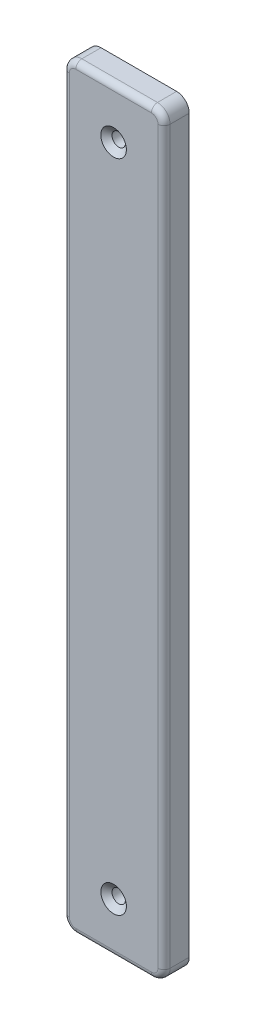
ISO-10303-21;
HEADER;
FILE_DESCRIPTION(('STEP AP214'),'2;1');
FILE_NAME('part.step','',(''),(''),'','','');
FILE_SCHEMA(('AUTOMOTIVE_DESIGN { 1 0 10303 214 1 1 1 1 }'));
ENDSEC;
DATA;
#1=APPLICATION_CONTEXT('core data for automotive mechanical design processes');
#2=APPLICATION_PROTOCOL_DEFINITION('international standard','automotive_design',2000,#1);
#3=PRODUCT_CONTEXT('',#1,'mechanical');
#4=PRODUCT('Part','Part','',(#3));
#5=PRODUCT_RELATED_PRODUCT_CATEGORY('part','',(#4));
#6=PRODUCT_DEFINITION_FORMATION('','',#4);
#7=PRODUCT_DEFINITION_CONTEXT('part definition',#1,'design');
#8=PRODUCT_DEFINITION('design','',#6,#7);
#9=PRODUCT_DEFINITION_SHAPE('','',#8);
#10=(LENGTH_UNIT() NAMED_UNIT(*) SI_UNIT(.MILLI.,.METRE.));
#11=(NAMED_UNIT(*) PLANE_ANGLE_UNIT() SI_UNIT($,.RADIAN.));
#12=(NAMED_UNIT(*) SI_UNIT($,.STERADIAN.) SOLID_ANGLE_UNIT());
#13=UNCERTAINTY_MEASURE_WITH_UNIT(LENGTH_MEASURE(1.E-05),#10,'distance_accuracy_value','');
#14=(GEOMETRIC_REPRESENTATION_CONTEXT(3) GLOBAL_UNCERTAINTY_ASSIGNED_CONTEXT((#13)) GLOBAL_UNIT_ASSIGNED_CONTEXT((#10,
#11,#12)) REPRESENTATION_CONTEXT('',''));
#15=CARTESIAN_POINT('',(0.,0.,0.));
#16=DIRECTION('',(0.,0.,1.));
#17=DIRECTION('',(1.,0.,0.));
#18=AXIS2_PLACEMENT_3D('',#15,#16,#17);
#19=CARTESIAN_POINT('',(25.4,-190.5,12.7));
#20=DIRECTION('',(-1.,0.,0.));
#21=DIRECTION('',(0.,0.,1.));
#22=AXIS2_PLACEMENT_3D('',#19,#20,#21);
#23=PLANE('',#22);
#24=DIRECTION('',(0.,0.,-1.));
#25=VECTOR('',#24,1.);
#26=CARTESIAN_POINT('',(25.4,184.15,12.7));
#27=LINE('',#26,#25);
#28=CARTESIAN_POINT('',(25.4,184.15,0.));
#29=VERTEX_POINT('',#28);
#30=CARTESIAN_POINT('',(25.4,184.15,9.652));
#31=VERTEX_POINT('',#30);
#32=EDGE_CURVE('E138',#29,#31,#27,.F.);
#33=ORIENTED_EDGE('',*,*,#32,.T.);
#34=DIRECTION('',(0.,1.,0.));
#35=VECTOR('',#34,1.);
#36=CARTESIAN_POINT('',(25.4,-190.5,9.652));
#37=LINE('',#36,#35);
#38=CARTESIAN_POINT('',(25.4,-184.15,9.652));
#39=VERTEX_POINT('',#38);
#40=EDGE_CURVE('E134',#31,#39,#37,.F.);
#41=ORIENTED_EDGE('',*,*,#40,.T.);
#42=DIRECTION('',(0.,0.,-1.));
#43=VECTOR('',#42,1.);
#44=CARTESIAN_POINT('',(25.4,-184.15,0.));
#45=LINE('',#44,#43);
#46=CARTESIAN_POINT('',(25.4,-184.15,0.));
#47=VERTEX_POINT('',#46);
#48=EDGE_CURVE('E127',#39,#47,#45,.T.);
#49=ORIENTED_EDGE('',*,*,#48,.T.);
#50=DIRECTION('',(0.,1.,0.));
#51=VECTOR('',#50,1.);
#52=CARTESIAN_POINT('',(25.4,-190.5,0.));
#53=LINE('',#52,#51);
#54=EDGE_CURVE('E131',#47,#29,#53,.T.);
#55=ORIENTED_EDGE('',*,*,#54,.T.);
#56=EDGE_LOOP('',(#33,#41,#49,#55));
#57=FACE_BOUND('',#56,.T.);
#58=ADVANCED_FACE('F36',(#57),#23,.F.);
#59=CARTESIAN_POINT('',(-25.4,190.5,12.7));
#60=DIRECTION('',(0.,1.,0.));
#61=DIRECTION('',(0.,0.,1.));
#62=AXIS2_PLACEMENT_3D('',#59,#60,#61);
#63=PLANE('',#62);
#64=DIRECTION('',(0.,0.,-1.));
#65=VECTOR('',#64,1.);
#66=CARTESIAN_POINT('',(-19.05,190.5,12.7));
#67=LINE('',#66,#65);
#68=CARTESIAN_POINT('',(-19.05,190.5,0.));
#69=VERTEX_POINT('',#68);
#70=CARTESIAN_POINT('',(-19.05,190.5,9.652));
#71=VERTEX_POINT('',#70);
#72=EDGE_CURVE('E186',#69,#71,#67,.F.);
#73=ORIENTED_EDGE('',*,*,#72,.T.);
#74=DIRECTION('',(1.,0.,0.));
#75=VECTOR('',#74,1.);
#76=CARTESIAN_POINT('',(19.05,190.5,9.652));
#77=LINE('',#76,#75);
#78=CARTESIAN_POINT('',(19.05,190.5,9.652));
#79=VERTEX_POINT('',#78);
#80=EDGE_CURVE('E209',#71,#79,#77,.T.);
#81=ORIENTED_EDGE('',*,*,#80,.T.);
#82=DIRECTION('',(0.,0.,-1.));
#83=VECTOR('',#82,1.);
#84=CARTESIAN_POINT('',(19.05,190.5,0.));
#85=LINE('',#84,#83);
#86=CARTESIAN_POINT('',(19.05,190.5,0.));
#87=VERTEX_POINT('',#86);
#88=EDGE_CURVE('E184',#79,#87,#85,.T.);
#89=ORIENTED_EDGE('',*,*,#88,.T.);
#90=DIRECTION('',(1.,0.,0.));
#91=VECTOR('',#90,1.);
#92=CARTESIAN_POINT('',(-25.4,190.5,0.));
#93=LINE('',#92,#91);
#94=EDGE_CURVE('E154',#69,#87,#93,.T.);
#95=ORIENTED_EDGE('',*,*,#94,.F.);
#96=EDGE_LOOP('',(#73,#81,#89,#95));
#97=FACE_BOUND('',#96,.T.);
#98=ADVANCED_FACE('F284',(#97),#63,.T.);
#99=CARTESIAN_POINT('',(-25.4,190.5,12.7));
#100=DIRECTION('',(1.,0.,0.));
#101=DIRECTION('',(0.,0.,-1.));
#102=AXIS2_PLACEMENT_3D('',#99,#100,#101);
#103=PLANE('',#102);
#104=DIRECTION('',(0.,0.,-1.));
#105=VECTOR('',#104,1.);
#106=CARTESIAN_POINT('',(-25.4,-184.15,12.7));
#107=LINE('',#106,#105);
#108=CARTESIAN_POINT('',(-25.4,-184.15,0.));
#109=VERTEX_POINT('',#108);
#110=CARTESIAN_POINT('',(-25.4,-184.15,9.652));
#111=VERTEX_POINT('',#110);
#112=EDGE_CURVE('E182',#109,#111,#107,.F.);
#113=ORIENTED_EDGE('',*,*,#112,.T.);
#114=DIRECTION('',(0.,-1.,0.));
#115=VECTOR('',#114,1.);
#116=CARTESIAN_POINT('',(-25.4,190.5,9.652));
#117=LINE('',#116,#115);
#118=CARTESIAN_POINT('',(-25.4,184.15,9.652));
#119=VERTEX_POINT('',#118);
#120=EDGE_CURVE('E11',#111,#119,#117,.F.);
#121=ORIENTED_EDGE('',*,*,#120,.T.);
#122=DIRECTION('',(0.,0.,-1.));
#123=VECTOR('',#122,1.);
#124=CARTESIAN_POINT('',(-25.4,184.15,0.));
#125=LINE('',#124,#123);
#126=CARTESIAN_POINT('',(-25.4,184.15,0.));
#127=VERTEX_POINT('',#126);
#128=EDGE_CURVE('E180',#119,#127,#125,.T.);
#129=ORIENTED_EDGE('',*,*,#128,.T.);
#130=DIRECTION('',(0.,-1.,0.));
#131=VECTOR('',#130,1.);
#132=CARTESIAN_POINT('',(-25.4,190.5,0.));
#133=LINE('',#132,#131);
#134=EDGE_CURVE('E161',#127,#109,#133,.T.);
#135=ORIENTED_EDGE('',*,*,#134,.T.);
#136=EDGE_LOOP('',(#113,#121,#129,#135));
#137=FACE_BOUND('',#136,.T.);
#138=ADVANCED_FACE('F279',(#137),#103,.F.);
#139=CARTESIAN_POINT('',(25.4,-190.5,12.7));
#140=DIRECTION('',(0.,-1.,0.));
#141=DIRECTION('',(0.,0.,-1.));
#142=AXIS2_PLACEMENT_3D('',#139,#140,#141);
#143=PLANE('',#142);
#144=DIRECTION('',(0.,0.,-1.));
#145=VECTOR('',#144,1.);
#146=CARTESIAN_POINT('',(19.05,-190.5,12.7));
#147=LINE('',#146,#145);
#148=CARTESIAN_POINT('',(19.05,-190.5,0.));
#149=VERTEX_POINT('',#148);
#150=CARTESIAN_POINT('',(19.05,-190.5,9.652));
#151=VERTEX_POINT('',#150);
#152=EDGE_CURVE('E143',#149,#151,#147,.F.);
#153=ORIENTED_EDGE('',*,*,#152,.T.);
#154=DIRECTION('',(-1.,0.,0.));
#155=VECTOR('',#154,1.);
#156=CARTESIAN_POINT('',(-19.05,-190.5,9.652));
#157=LINE('',#156,#155);
#158=CARTESIAN_POINT('',(-19.05,-190.5,9.652));
#159=VERTEX_POINT('',#158);
#160=EDGE_CURVE('E60',#151,#159,#157,.T.);
#161=ORIENTED_EDGE('',*,*,#160,.T.);
#162=DIRECTION('',(0.,0.,-1.));
#163=VECTOR('',#162,1.);
#164=CARTESIAN_POINT('',(-19.05,-190.5,0.));
#165=LINE('',#164,#163);
#166=CARTESIAN_POINT('',(-19.05,-190.5,0.));
#167=VERTEX_POINT('',#166);
#168=EDGE_CURVE('E147',#159,#167,#165,.T.);
#169=ORIENTED_EDGE('',*,*,#168,.T.);
#170=DIRECTION('',(-1.,0.,0.));
#171=VECTOR('',#170,1.);
#172=CARTESIAN_POINT('',(25.4,-190.5,0.));
#173=LINE('',#172,#171);
#174=EDGE_CURVE('E170',#149,#167,#173,.T.);
#175=ORIENTED_EDGE('',*,*,#174,.F.);
#176=EDGE_LOOP('',(#153,#161,#169,#175));
#177=FACE_BOUND('',#176,.T.);
#178=ADVANCED_FACE('F270',(#177),#143,.T.);
#179=CARTESIAN_POINT('',(25.4,190.5,12.7));
#180=DIRECTION('',(0.,0.,-1.));
#181=DIRECTION('',(-1.,0.,0.));
#182=AXIS2_PLACEMENT_3D('',#179,#180,#181);
#183=PLANE('',#182);
#184=DIRECTION('',(1.,0.,0.));
#185=VECTOR('',#184,1.);
#186=CARTESIAN_POINT('',(-19.05,187.452,12.7));
#187=LINE('',#186,#185);
#188=CARTESIAN_POINT('',(19.05,187.452,12.7));
#189=VERTEX_POINT('',#188);
#190=CARTESIAN_POINT('',(-19.05,187.452,12.7));
#191=VERTEX_POINT('',#190);
#192=EDGE_CURVE('E201',#189,#191,#187,.F.);
#193=ORIENTED_EDGE('',*,*,#192,.T.);
#194=CARTESIAN_POINT('',(-19.05,184.15,12.7));
#195=DIRECTION('',(0.,0.,-1.));
#196=DIRECTION('',(-1.,0.,0.));
#197=AXIS2_PLACEMENT_3D('',#194,#195,#196);
#198=CIRCLE('',#197,3.302);
#199=CARTESIAN_POINT('',(-22.352,184.15,12.7));
#200=VERTEX_POINT('',#199);
#201=EDGE_CURVE('E203',#191,#200,#198,.F.);
#202=ORIENTED_EDGE('',*,*,#201,.T.);
#203=DIRECTION('',(0.,-1.,0.));
#204=VECTOR('',#203,1.);
#205=CARTESIAN_POINT('',(-22.352,190.5,12.7));
#206=LINE('',#205,#204);
#207=CARTESIAN_POINT('',(-22.352,-184.15,12.7));
#208=VERTEX_POINT('',#207);
#209=EDGE_CURVE('E189',#200,#208,#206,.T.);
#210=ORIENTED_EDGE('',*,*,#209,.T.);
#211=CARTESIAN_POINT('',(-19.05,-184.15,12.7));
#212=DIRECTION('',(0.,0.,-1.));
#213=DIRECTION('',(-1.,0.,0.));
#214=AXIS2_PLACEMENT_3D('',#211,#212,#213);
#215=CIRCLE('',#214,3.302);
#216=CARTESIAN_POINT('',(-19.05,-187.452,12.7));
#217=VERTEX_POINT('',#216);
#218=EDGE_CURVE('E191',#208,#217,#215,.F.);
#219=ORIENTED_EDGE('',*,*,#218,.T.);
#220=DIRECTION('',(-1.,0.,0.));
#221=VECTOR('',#220,1.);
#222=CARTESIAN_POINT('',(19.05,-187.452,12.7));
#223=LINE('',#222,#221);
#224=CARTESIAN_POINT('',(19.05,-187.452,12.7));
#225=VERTEX_POINT('',#224);
#226=EDGE_CURVE('E193',#217,#225,#223,.F.);
#227=ORIENTED_EDGE('',*,*,#226,.T.);
#228=CARTESIAN_POINT('',(19.05,-184.15,12.7));
#229=DIRECTION('',(0.,0.,-1.));
#230=DIRECTION('',(-1.,0.,0.));
#231=AXIS2_PLACEMENT_3D('',#228,#229,#230);
#232=CIRCLE('',#231,3.302);
#233=CARTESIAN_POINT('',(22.352,-184.15,12.7));
#234=VERTEX_POINT('',#233);
#235=EDGE_CURVE('E195',#225,#234,#232,.F.);
#236=ORIENTED_EDGE('',*,*,#235,.T.);
#237=DIRECTION('',(0.,1.,0.));
#238=VECTOR('',#237,1.);
#239=CARTESIAN_POINT('',(22.352,190.5,12.7));
#240=LINE('',#239,#238);
#241=CARTESIAN_POINT('',(22.352,184.15,12.7));
#242=VERTEX_POINT('',#241);
#243=EDGE_CURVE('E197',#234,#242,#240,.T.);
#244=ORIENTED_EDGE('',*,*,#243,.T.);
#245=CARTESIAN_POINT('',(19.05,184.15,12.7));
#246=DIRECTION('',(0.,0.,-1.));
#247=DIRECTION('',(-1.,0.,0.));
#248=AXIS2_PLACEMENT_3D('',#245,#246,#247);
#249=CIRCLE('',#248,3.302);
#250=EDGE_CURVE('E199',#242,#189,#249,.F.);
#251=ORIENTED_EDGE('',*,*,#250,.T.);
#252=EDGE_LOOP('',(#193,#202,#210,#219,#227,#236,#244,#251));
#253=FACE_BOUND('',#252,.T.);
#254=CARTESIAN_POINT('',(0.,165.1,12.7));
#255=DIRECTION('',(0.,0.,1.));
#256=DIRECTION('',(1.,0.,0.));
#257=AXIS2_PLACEMENT_3D('',#254,#255,#256);
#258=CIRCLE('',#257,6.4389);
#259=CARTESIAN_POINT('',(6.43890000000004,165.1,12.7));
#260=VERTEX_POINT('',#259);
#261=EDGE_CURVE('E239',#260,#260,#258,.T.);
#262=ORIENTED_EDGE('',*,*,#261,.F.);
#263=EDGE_LOOP('',(#262));
#264=FACE_BOUND('',#263,.T.);
#265=CARTESIAN_POINT('',(0.,-165.1,12.7));
#266=DIRECTION('',(0.,0.,1.));
#267=DIRECTION('',(1.,0.,0.));
#268=AXIS2_PLACEMENT_3D('',#265,#266,#267);
#269=CIRCLE('',#268,6.4389);
#270=CARTESIAN_POINT('',(6.43890000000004,-165.1,12.7));
#271=VERTEX_POINT('',#270);
#272=EDGE_CURVE('E254',#271,#271,#269,.T.);
#273=ORIENTED_EDGE('',*,*,#272,.F.);
#274=EDGE_LOOP('',(#273));
#275=FACE_BOUND('',#274,.T.);
#276=ADVANCED_FACE('F268',(#253,#264,#275),#183,.F.);
#277=CARTESIAN_POINT('',(25.4,190.5,0.));
#278=DIRECTION('',(0.,0.,-1.));
#279=DIRECTION('',(-1.,0.,0.));
#280=AXIS2_PLACEMENT_3D('',#277,#278,#279);
#281=PLANE('',#280);
#282=CARTESIAN_POINT('',(0.,165.1,0.));
#283=DIRECTION('',(0.,0.,1.));
#284=DIRECTION('',(1.,0.,0.));
#285=AXIS2_PLACEMENT_3D('',#282,#283,#284);
#286=CIRCLE('',#285,3.3782);
#287=CARTESIAN_POINT('',(3.37820000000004,165.1,0.));
#288=VERTEX_POINT('',#287);
#289=EDGE_CURVE('E249',#288,#288,#286,.T.);
#290=ORIENTED_EDGE('',*,*,#289,.T.);
#291=EDGE_LOOP('',(#290));
#292=FACE_BOUND('',#291,.T.);
#293=CARTESIAN_POINT('',(0.,-165.1,0.));
#294=DIRECTION('',(0.,0.,1.));
#295=DIRECTION('',(1.,0.,0.));
#296=AXIS2_PLACEMENT_3D('',#293,#294,#295);
#297=CIRCLE('',#296,3.3782);
#298=CARTESIAN_POINT('',(3.37820000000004,-165.1,0.));
#299=VERTEX_POINT('',#298);
#300=EDGE_CURVE('E155',#299,#299,#297,.T.);
#301=ORIENTED_EDGE('',*,*,#300,.T.);
#302=EDGE_LOOP('',(#301));
#303=FACE_BOUND('',#302,.T.);
#304=ORIENTED_EDGE('',*,*,#54,.F.);
#305=CARTESIAN_POINT('',(19.05,-184.15,0.));
#306=DIRECTION('',(0.,0.,-1.));
#307=DIRECTION('',(-1.,0.,0.));
#308=AXIS2_PLACEMENT_3D('',#305,#306,#307);
#309=CIRCLE('',#308,6.35);
#310=EDGE_CURVE('E141',#47,#149,#309,.T.);
#311=ORIENTED_EDGE('',*,*,#310,.T.);
#312=ORIENTED_EDGE('',*,*,#174,.T.);
#313=CARTESIAN_POINT('',(-19.05,-184.15,0.));
#314=DIRECTION('',(0.,0.,-1.));
#315=DIRECTION('',(-1.,0.,0.));
#316=AXIS2_PLACEMENT_3D('',#313,#314,#315);
#317=CIRCLE('',#316,6.35);
#318=EDGE_CURVE('E148',#167,#109,#317,.T.);
#319=ORIENTED_EDGE('',*,*,#318,.T.);
#320=ORIENTED_EDGE('',*,*,#134,.F.);
#321=CARTESIAN_POINT('',(-19.05,184.15,0.));
#322=DIRECTION('',(0.,0.,-1.));
#323=DIRECTION('',(-1.,0.,0.));
#324=AXIS2_PLACEMENT_3D('',#321,#322,#323);
#325=CIRCLE('',#324,6.35);
#326=EDGE_CURVE('E175',#127,#69,#325,.T.);
#327=ORIENTED_EDGE('',*,*,#326,.T.);
#328=ORIENTED_EDGE('',*,*,#94,.T.);
#329=CARTESIAN_POINT('',(19.05,184.15,0.));
#330=DIRECTION('',(0.,0.,-1.));
#331=DIRECTION('',(-1.,0.,0.));
#332=AXIS2_PLACEMENT_3D('',#329,#330,#331);
#333=CIRCLE('',#332,6.35);
#334=EDGE_CURVE('E137',#87,#29,#333,.T.);
#335=ORIENTED_EDGE('',*,*,#334,.T.);
#336=EDGE_LOOP('',(#304,#311,#312,#319,#320,#327,#328,#335));
#337=FACE_BOUND('',#336,.T.);
#338=ADVANCED_FACE('F150',(#292,#303,#337),#281,.T.);
#339=CARTESIAN_POINT('',(0.,-165.1,12.7));
#340=DIRECTION('',(0.,0.,1.));
#341=DIRECTION('',(1.,0.,0.));
#342=AXIS2_PLACEMENT_3D('',#339,#340,#341);
#343=CYLINDRICAL_SURFACE('',#342,3.3782);
#344=ORIENTED_EDGE('',*,*,#300,.F.);
#345=EDGE_LOOP('',(#344));
#346=FACE_BOUND('',#345,.T.);
#347=CARTESIAN_POINT('',(0.,-165.1,10.1317677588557));
#348=DIRECTION('',(0.,0.,1.));
#349=DIRECTION('',(1.,0.,0.));
#350=AXIS2_PLACEMENT_3D('',#347,#348,#349);
#351=CIRCLE('',#350,3.3782);
#352=CARTESIAN_POINT('',(3.37820000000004,-165.1,10.1317677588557));
#353=VERTEX_POINT('',#352);
#354=EDGE_CURVE('E164',#353,#353,#351,.T.);
#355=ORIENTED_EDGE('',*,*,#354,.T.);
#356=EDGE_LOOP('',(#355));
#357=FACE_BOUND('',#356,.T.);
#358=ADVANCED_FACE('F259',(#346,#357),#343,.F.);
#359=CARTESIAN_POINT('',(0.,-165.1,12.7));
#360=DIRECTION('',(0.,0.,1.));
#361=DIRECTION('',(1.,0.,0.));
#362=AXIS2_PLACEMENT_3D('',#359,#360,#361);
#363=CONICAL_SURFACE('',#362,6.4389,0.872664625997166);
#364=ORIENTED_EDGE('',*,*,#354,.F.);
#365=EDGE_LOOP('',(#364));
#366=FACE_BOUND('',#365,.T.);
#367=ORIENTED_EDGE('',*,*,#272,.T.);
#368=EDGE_LOOP('',(#367));
#369=FACE_BOUND('',#368,.T.);
#370=ADVANCED_FACE('F261',(#366,#369),#363,.F.);
#371=CARTESIAN_POINT('',(0.,165.1,12.7));
#372=DIRECTION('',(0.,0.,1.));
#373=DIRECTION('',(1.,0.,0.));
#374=AXIS2_PLACEMENT_3D('',#371,#372,#373);
#375=CYLINDRICAL_SURFACE('',#374,3.3782);
#376=ORIENTED_EDGE('',*,*,#289,.F.);
#377=EDGE_LOOP('',(#376));
#378=FACE_BOUND('',#377,.T.);
#379=CARTESIAN_POINT('',(0.,165.1,10.1317677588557));
#380=DIRECTION('',(0.,0.,1.));
#381=DIRECTION('',(1.,0.,0.));
#382=AXIS2_PLACEMENT_3D('',#379,#380,#381);
#383=CIRCLE('',#382,3.3782);
#384=CARTESIAN_POINT('',(3.37820000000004,165.1,10.1317677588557));
#385=VERTEX_POINT('',#384);
#386=EDGE_CURVE('E244',#385,#385,#383,.T.);
#387=ORIENTED_EDGE('',*,*,#386,.T.);
#388=EDGE_LOOP('',(#387));
#389=FACE_BOUND('',#388,.T.);
#390=ADVANCED_FACE('F264',(#378,#389),#375,.F.);
#391=CARTESIAN_POINT('',(0.,165.1,12.7));
#392=DIRECTION('',(0.,0.,1.));
#393=DIRECTION('',(1.,0.,0.));
#394=AXIS2_PLACEMENT_3D('',#391,#392,#393);
#395=CONICAL_SURFACE('',#394,6.4389,0.872664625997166);
#396=ORIENTED_EDGE('',*,*,#386,.F.);
#397=EDGE_LOOP('',(#396));
#398=FACE_BOUND('',#397,.T.);
#399=ORIENTED_EDGE('',*,*,#261,.T.);
#400=EDGE_LOOP('',(#399));
#401=FACE_BOUND('',#400,.T.);
#402=ADVANCED_FACE('F296',(#398,#401),#395,.F.);
#403=CARTESIAN_POINT('',(19.05,-184.15,12.7));
#404=DIRECTION('',(0.,0.,1.));
#405=DIRECTION('',(1.,0.,0.));
#406=AXIS2_PLACEMENT_3D('',#403,#404,#405);
#407=CYLINDRICAL_SURFACE('',#406,6.35);
#408=ORIENTED_EDGE('',*,*,#48,.F.);
#409=CARTESIAN_POINT('',(19.05,-184.15,9.652));
#410=DIRECTION('',(0.,0.,-1.));
#411=DIRECTION('',(-1.,0.,0.));
#412=AXIS2_PLACEMENT_3D('',#409,#410,#411);
#413=CIRCLE('',#412,6.35);
#414=EDGE_CURVE('E214',#39,#151,#413,.T.);
#415=ORIENTED_EDGE('',*,*,#414,.T.);
#416=ORIENTED_EDGE('',*,*,#152,.F.);
#417=ORIENTED_EDGE('',*,*,#310,.F.);
#418=EDGE_LOOP('',(#408,#415,#416,#417));
#419=FACE_BOUND('',#418,.T.);
#420=ADVANCED_FACE('F142',(#419),#407,.T.);
#421=CARTESIAN_POINT('',(-19.05,-184.15,12.7));
#422=DIRECTION('',(0.,0.,1.));
#423=DIRECTION('',(1.,0.,0.));
#424=AXIS2_PLACEMENT_3D('',#421,#422,#423);
#425=CYLINDRICAL_SURFACE('',#424,6.35);
#426=ORIENTED_EDGE('',*,*,#168,.F.);
#427=CARTESIAN_POINT('',(-19.05,-184.15,9.652));
#428=DIRECTION('',(0.,0.,-1.));
#429=DIRECTION('',(-1.,0.,0.));
#430=AXIS2_PLACEMENT_3D('',#427,#428,#429);
#431=CIRCLE('',#430,6.35);
#432=EDGE_CURVE('E45',#159,#111,#431,.T.);
#433=ORIENTED_EDGE('',*,*,#432,.T.);
#434=ORIENTED_EDGE('',*,*,#112,.F.);
#435=ORIENTED_EDGE('',*,*,#318,.F.);
#436=EDGE_LOOP('',(#426,#433,#434,#435));
#437=FACE_BOUND('',#436,.T.);
#438=ADVANCED_FACE('F295',(#437),#425,.T.);
#439=CARTESIAN_POINT('',(-19.05,184.15,12.7));
#440=DIRECTION('',(0.,0.,1.));
#441=DIRECTION('',(1.,0.,0.));
#442=AXIS2_PLACEMENT_3D('',#439,#440,#441);
#443=CYLINDRICAL_SURFACE('',#442,6.35);
#444=ORIENTED_EDGE('',*,*,#128,.F.);
#445=CARTESIAN_POINT('',(-19.05,184.15,9.652));
#446=DIRECTION('',(0.,0.,-1.));
#447=DIRECTION('',(-1.,0.,0.));
#448=AXIS2_PLACEMENT_3D('',#445,#446,#447);
#449=CIRCLE('',#448,6.35);
#450=EDGE_CURVE('E206',#119,#71,#449,.T.);
#451=ORIENTED_EDGE('',*,*,#450,.T.);
#452=ORIENTED_EDGE('',*,*,#72,.F.);
#453=ORIENTED_EDGE('',*,*,#326,.F.);
#454=EDGE_LOOP('',(#444,#451,#452,#453));
#455=FACE_BOUND('',#454,.T.);
#456=ADVANCED_FACE('F299',(#455),#443,.T.);
#457=CARTESIAN_POINT('',(19.05,184.15,12.7));
#458=DIRECTION('',(0.,0.,1.));
#459=DIRECTION('',(1.,0.,0.));
#460=AXIS2_PLACEMENT_3D('',#457,#458,#459);
#461=CYLINDRICAL_SURFACE('',#460,6.35);
#462=ORIENTED_EDGE('',*,*,#88,.F.);
#463=CARTESIAN_POINT('',(19.05,184.15,9.652));
#464=DIRECTION('',(0.,0.,-1.));
#465=DIRECTION('',(-1.,0.,0.));
#466=AXIS2_PLACEMENT_3D('',#463,#464,#465);
#467=CIRCLE('',#466,6.35);
#468=EDGE_CURVE('E211',#79,#31,#467,.T.);
#469=ORIENTED_EDGE('',*,*,#468,.T.);
#470=ORIENTED_EDGE('',*,*,#32,.F.);
#471=ORIENTED_EDGE('',*,*,#334,.F.);
#472=EDGE_LOOP('',(#462,#469,#470,#471));
#473=FACE_BOUND('',#472,.T.);
#474=ADVANCED_FACE('F302',(#473),#461,.T.);
#475=CARTESIAN_POINT('',(19.05,-184.15,9.652));
#476=DIRECTION('',(0.,0.,-1.));
#477=DIRECTION('',(-1.,0.,0.));
#478=AXIS2_PLACEMENT_3D('',#475,#476,#477);
#479=TOROIDAL_SURFACE('',#478,3.302,3.048);
#480=CARTESIAN_POINT('',(19.05,-187.452,9.652));
#481=DIRECTION('',(-1.,0.,0.));
#482=DIRECTION('',(0.,0.,1.));
#483=AXIS2_PLACEMENT_3D('',#480,#481,#482);
#484=CIRCLE('',#483,3.048);
#485=EDGE_CURVE('E233',#151,#225,#484,.T.);
#486=ORIENTED_EDGE('',*,*,#485,.F.);
#487=ORIENTED_EDGE('',*,*,#414,.F.);
#488=CARTESIAN_POINT('',(22.352,-184.15,9.652));
#489=DIRECTION('',(0.,1.,0.));
#490=DIRECTION('',(0.,0.,1.));
#491=AXIS2_PLACEMENT_3D('',#488,#489,#490);
#492=CIRCLE('',#491,3.048);
#493=EDGE_CURVE('E40',#234,#39,#492,.T.);
#494=ORIENTED_EDGE('',*,*,#493,.F.);
#495=ORIENTED_EDGE('',*,*,#235,.F.);
#496=EDGE_LOOP('',(#486,#487,#494,#495));
#497=FACE_BOUND('',#496,.T.);
#498=ADVANCED_FACE('F38',(#497),#479,.T.);
#499=CARTESIAN_POINT('',(22.352,190.5,9.652));
#500=DIRECTION('',(0.,1.,0.));
#501=DIRECTION('',(0.,0.,1.));
#502=AXIS2_PLACEMENT_3D('',#499,#500,#501);
#503=CYLINDRICAL_SURFACE('',#502,3.048);
#504=ORIENTED_EDGE('',*,*,#493,.T.);
#505=ORIENTED_EDGE('',*,*,#40,.F.);
#506=CARTESIAN_POINT('',(22.352,184.15,9.652));
#507=DIRECTION('',(0.,1.,0.));
#508=DIRECTION('',(0.,0.,1.));
#509=AXIS2_PLACEMENT_3D('',#506,#507,#508);
#510=CIRCLE('',#509,3.048);
#511=EDGE_CURVE('E231',#242,#31,#510,.T.);
#512=ORIENTED_EDGE('',*,*,#511,.F.);
#513=ORIENTED_EDGE('',*,*,#243,.F.);
#514=EDGE_LOOP('',(#504,#505,#512,#513));
#515=FACE_BOUND('',#514,.T.);
#516=ADVANCED_FACE('F329',(#515),#503,.T.);
#517=CARTESIAN_POINT('',(25.4,-187.452,9.652));
#518=DIRECTION('',(1.,0.,0.));
#519=DIRECTION('',(0.,0.,-1.));
#520=AXIS2_PLACEMENT_3D('',#517,#518,#519);
#521=CYLINDRICAL_SURFACE('',#520,3.048);
#522=ORIENTED_EDGE('',*,*,#485,.T.);
#523=ORIENTED_EDGE('',*,*,#226,.F.);
#524=CARTESIAN_POINT('',(-19.05,-187.452,9.652));
#525=DIRECTION('',(-1.,0.,0.));
#526=DIRECTION('',(0.,0.,1.));
#527=AXIS2_PLACEMENT_3D('',#524,#525,#526);
#528=CIRCLE('',#527,3.048);
#529=EDGE_CURVE('E228',#159,#217,#528,.T.);
#530=ORIENTED_EDGE('',*,*,#529,.F.);
#531=ORIENTED_EDGE('',*,*,#160,.F.);
#532=EDGE_LOOP('',(#522,#523,#530,#531));
#533=FACE_BOUND('',#532,.T.);
#534=ADVANCED_FACE('F326',(#533),#521,.T.);
#535=CARTESIAN_POINT('',(19.05,184.15,9.652));
#536=DIRECTION('',(0.,0.,-1.));
#537=DIRECTION('',(-1.,0.,0.));
#538=AXIS2_PLACEMENT_3D('',#535,#536,#537);
#539=TOROIDAL_SURFACE('',#538,3.302,3.048);
#540=ORIENTED_EDGE('',*,*,#511,.T.);
#541=ORIENTED_EDGE('',*,*,#468,.F.);
#542=CARTESIAN_POINT('',(19.05,187.452,9.652));
#543=DIRECTION('',(-1.,0.,0.));
#544=DIRECTION('',(0.,0.,1.));
#545=AXIS2_PLACEMENT_3D('',#542,#543,#544);
#546=CIRCLE('',#545,3.048);
#547=EDGE_CURVE('E225',#189,#79,#546,.T.);
#548=ORIENTED_EDGE('',*,*,#547,.F.);
#549=ORIENTED_EDGE('',*,*,#250,.F.);
#550=EDGE_LOOP('',(#540,#541,#548,#549));
#551=FACE_BOUND('',#550,.T.);
#552=ADVANCED_FACE('F322',(#551),#539,.T.);
#553=CARTESIAN_POINT('',(-19.05,-184.15,9.652));
#554=DIRECTION('',(0.,0.,-1.));
#555=DIRECTION('',(-1.,0.,0.));
#556=AXIS2_PLACEMENT_3D('',#553,#554,#555);
#557=TOROIDAL_SURFACE('',#556,3.302,3.048);
#558=ORIENTED_EDGE('',*,*,#529,.T.);
#559=ORIENTED_EDGE('',*,*,#218,.F.);
#560=CARTESIAN_POINT('',(-22.352,-184.15,9.652));
#561=DIRECTION('',(0.,1.,0.));
#562=DIRECTION('',(0.,0.,1.));
#563=AXIS2_PLACEMENT_3D('',#560,#561,#562);
#564=CIRCLE('',#563,3.048);
#565=EDGE_CURVE('E222',#111,#208,#564,.T.);
#566=ORIENTED_EDGE('',*,*,#565,.F.);
#567=ORIENTED_EDGE('',*,*,#432,.F.);
#568=EDGE_LOOP('',(#558,#559,#566,#567));
#569=FACE_BOUND('',#568,.T.);
#570=ADVANCED_FACE('F318',(#569),#557,.T.);
#571=CARTESIAN_POINT('',(-25.4,187.452,9.652));
#572=DIRECTION('',(-1.,0.,0.));
#573=DIRECTION('',(0.,0.,1.));
#574=AXIS2_PLACEMENT_3D('',#571,#572,#573);
#575=CYLINDRICAL_SURFACE('',#574,3.048);
#576=ORIENTED_EDGE('',*,*,#547,.T.);
#577=ORIENTED_EDGE('',*,*,#80,.F.);
#578=CARTESIAN_POINT('',(-19.05,187.452,9.652));
#579=DIRECTION('',(-1.,0.,0.));
#580=DIRECTION('',(0.,0.,1.));
#581=AXIS2_PLACEMENT_3D('',#578,#579,#580);
#582=CIRCLE('',#581,3.048);
#583=EDGE_CURVE('E220',#191,#71,#582,.T.);
#584=ORIENTED_EDGE('',*,*,#583,.F.);
#585=ORIENTED_EDGE('',*,*,#192,.F.);
#586=EDGE_LOOP('',(#576,#577,#584,#585));
#587=FACE_BOUND('',#586,.T.);
#588=ADVANCED_FACE('F314',(#587),#575,.T.);
#589=CARTESIAN_POINT('',(-22.352,190.5,9.652));
#590=DIRECTION('',(0.,-1.,0.));
#591=DIRECTION('',(0.,0.,-1.));
#592=AXIS2_PLACEMENT_3D('',#589,#590,#591);
#593=CYLINDRICAL_SURFACE('',#592,3.048);
#594=ORIENTED_EDGE('',*,*,#565,.T.);
#595=ORIENTED_EDGE('',*,*,#209,.F.);
#596=CARTESIAN_POINT('',(-22.352,184.15,9.652));
#597=DIRECTION('',(0.,1.,0.));
#598=DIRECTION('',(0.,0.,1.));
#599=AXIS2_PLACEMENT_3D('',#596,#597,#598);
#600=CIRCLE('',#599,3.048);
#601=EDGE_CURVE('E218',#119,#200,#600,.T.);
#602=ORIENTED_EDGE('',*,*,#601,.F.);
#603=ORIENTED_EDGE('',*,*,#120,.F.);
#604=EDGE_LOOP('',(#594,#595,#602,#603));
#605=FACE_BOUND('',#604,.T.);
#606=ADVANCED_FACE('F310',(#605),#593,.T.);
#607=CARTESIAN_POINT('',(-19.05,184.15,9.652));
#608=DIRECTION('',(0.,0.,-1.));
#609=DIRECTION('',(-1.,0.,0.));
#610=AXIS2_PLACEMENT_3D('',#607,#608,#609);
#611=TOROIDAL_SURFACE('',#610,3.302,3.048);
#612=ORIENTED_EDGE('',*,*,#583,.T.);
#613=ORIENTED_EDGE('',*,*,#450,.F.);
#614=ORIENTED_EDGE('',*,*,#601,.T.);
#615=ORIENTED_EDGE('',*,*,#201,.F.);
#616=EDGE_LOOP('',(#612,#613,#614,#615));
#617=FACE_BOUND('',#616,.T.);
#618=ADVANCED_FACE('F307',(#617),#611,.T.);
#619=CLOSED_SHELL('',(#58,#98,#138,#178,#276,#338,#358,#370,#390,#402,#420,#438,#456,#474,#498,
#516,#534,#552,#570,#588,#606,#618));
#620=MANIFOLD_SOLID_BREP('B2',#619);
#621=ADVANCED_BREP_SHAPE_REPRESENTATION('',(#18,#620),#14);
#622=SHAPE_DEFINITION_REPRESENTATION(#9,#621);
ENDSEC;
END-ISO-10303-21;
